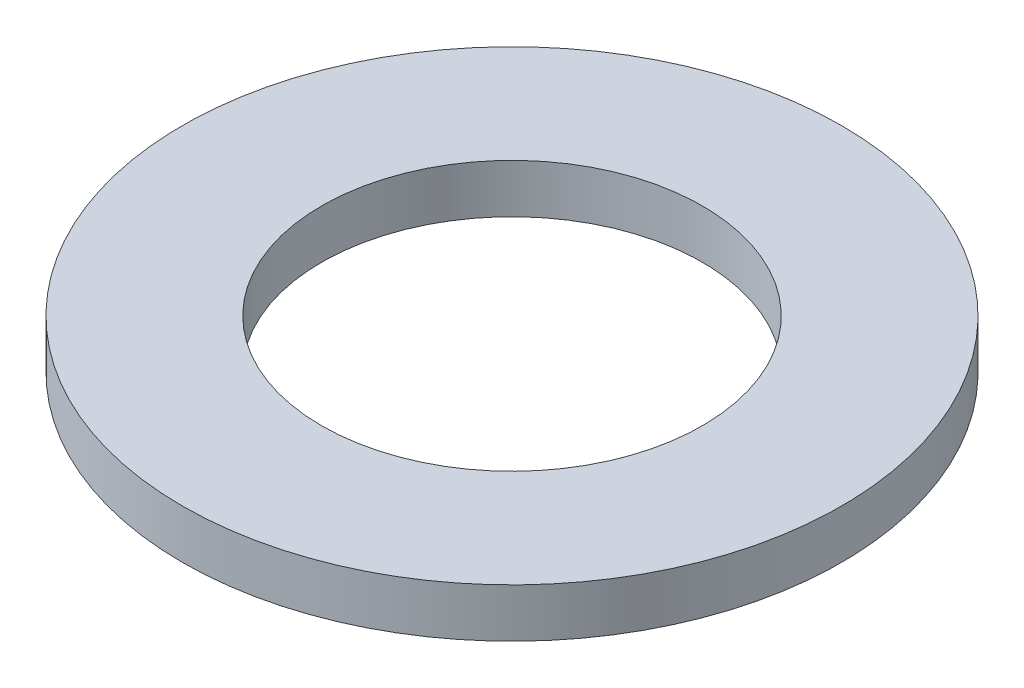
from build123d import *

# Parameters (mm, degrees)
SKETCH1_R      = 67.5
SKETCH1_R_2    = 39
EXTRUDE1_DEPTH = 10


with BuildPart() as part:
    # Sketch1 → Extrude1 (new body)
    with BuildSketch(Plane(origin=(0, 0, 0), x_dir=(1, 0, 0), z_dir=(0, 1, 0))):
        with Locations(Location((0, 0, 0), (0, 0, 270))):
            Circle(SKETCH1_R)
        with Locations(Location((0, 0, 0), (0, 0, 270))):
            Circle(SKETCH1_R_2, mode=Mode.SUBTRACT)
    extrude(amount=EXTRUDE1_DEPTH)


solid = part.part
